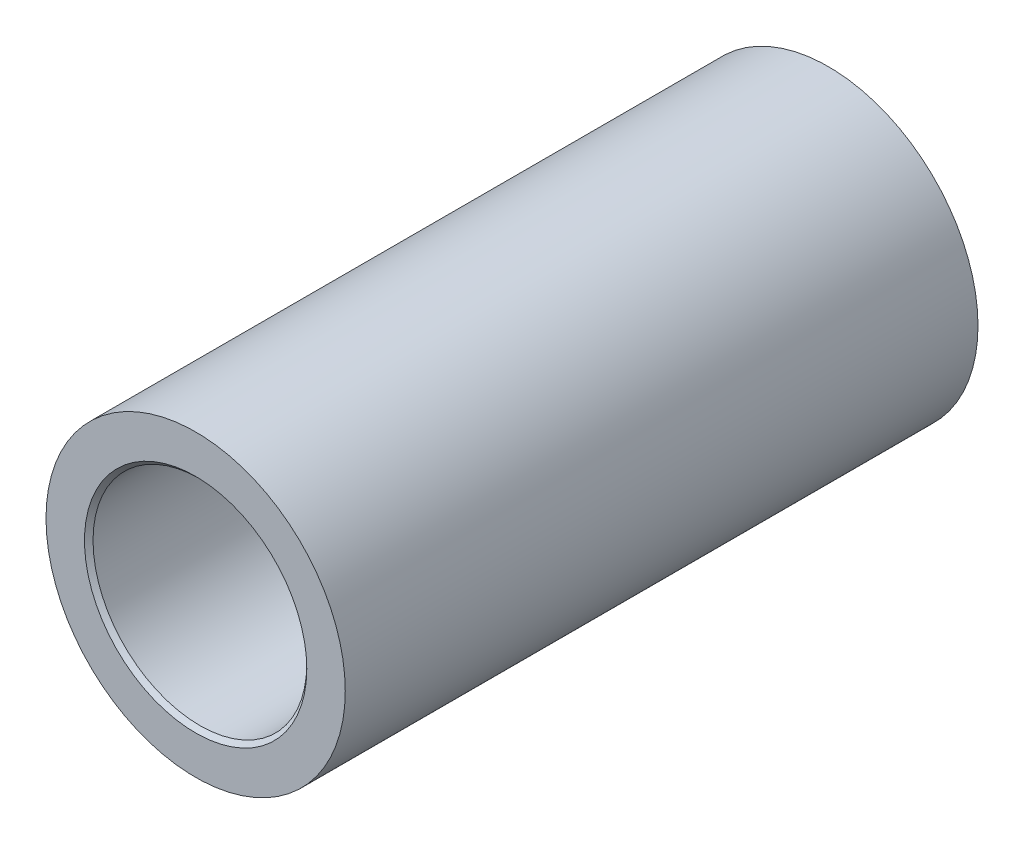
ISO-10303-21;
HEADER;
FILE_DESCRIPTION(('STEP AP214'),'2;1');
FILE_NAME('part.step','',(''),(''),'','','');
FILE_SCHEMA(('AUTOMOTIVE_DESIGN { 1 0 10303 214 1 1 1 1 }'));
ENDSEC;
DATA;
#1=APPLICATION_CONTEXT('core data for automotive mechanical design processes');
#2=APPLICATION_PROTOCOL_DEFINITION('international standard','automotive_design',2000,#1);
#3=PRODUCT_CONTEXT('',#1,'mechanical');
#4=PRODUCT('Part','Part','',(#3));
#5=PRODUCT_RELATED_PRODUCT_CATEGORY('part','',(#4));
#6=PRODUCT_DEFINITION_FORMATION('','',#4);
#7=PRODUCT_DEFINITION_CONTEXT('part definition',#1,'design');
#8=PRODUCT_DEFINITION('design','',#6,#7);
#9=PRODUCT_DEFINITION_SHAPE('','',#8);
#10=(LENGTH_UNIT() NAMED_UNIT(*) SI_UNIT(.MILLI.,.METRE.));
#11=(NAMED_UNIT(*) PLANE_ANGLE_UNIT() SI_UNIT($,.RADIAN.));
#12=(NAMED_UNIT(*) SI_UNIT($,.STERADIAN.) SOLID_ANGLE_UNIT());
#13=UNCERTAINTY_MEASURE_WITH_UNIT(LENGTH_MEASURE(1.E-05),#10,'distance_accuracy_value','');
#14=(GEOMETRIC_REPRESENTATION_CONTEXT(3) GLOBAL_UNCERTAINTY_ASSIGNED_CONTEXT((#13)) GLOBAL_UNIT_ASSIGNED_CONTEXT((#10,
#11,#12)) REPRESENTATION_CONTEXT('',''));
#15=CARTESIAN_POINT('',(0.,0.,0.));
#16=DIRECTION('',(0.,0.,1.));
#17=DIRECTION('',(1.,0.,0.));
#18=AXIS2_PLACEMENT_3D('',#15,#16,#17);
#19=CARTESIAN_POINT('',(0.,0.,73.9999999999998));
#20=DIRECTION('',(0.,0.,0.999999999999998));
#21=DIRECTION('',(1.,0.,0.));
#22=AXIS2_PLACEMENT_3D('',#19,#20,#21);
#23=PLANE('',#22);
#24=CARTESIAN_POINT('',(0.,0.,73.9999999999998));
#25=DIRECTION('',(0.,0.,0.999999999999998));
#26=DIRECTION('',(1.,0.,0.));
#27=AXIS2_PLACEMENT_3D('',#24,#25,#26);
#28=CIRCLE('',#27,13.);
#29=CARTESIAN_POINT('',(13.,0.,73.9999999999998));
#30=VERTEX_POINT('',#29);
#31=EDGE_CURVE('E10',#30,#30,#28,.F.);
#32=ORIENTED_EDGE('',*,*,#31,.T.);
#33=EDGE_LOOP('',(#32));
#34=FACE_BOUND('',#33,.T.);
#35=CARTESIAN_POINT('',(0.,0.,73.9999999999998));
#36=DIRECTION('',(0.,0.,0.999999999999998));
#37=DIRECTION('',(1.,0.,0.));
#38=AXIS2_PLACEMENT_3D('',#35,#36,#37);
#39=CIRCLE('',#38,17.5);
#40=CARTESIAN_POINT('',(-17.5,0.,73.9999999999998));
#41=VERTEX_POINT('',#40);
#42=EDGE_CURVE('E52',#41,#41,#39,.T.);
#43=ORIENTED_EDGE('',*,*,#42,.T.);
#44=EDGE_LOOP('',(#43));
#45=FACE_BOUND('',#44,.T.);
#46=ADVANCED_FACE('F32',(#34,#45),#23,.T.);
#47=CARTESIAN_POINT('',(0.,0.,0.));
#48=DIRECTION('',(0.,0.,0.999999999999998));
#49=DIRECTION('',(1.,0.,0.));
#50=AXIS2_PLACEMENT_3D('',#47,#48,#49);
#51=PLANE('',#50);
#52=CARTESIAN_POINT('',(0.,0.,0.));
#53=DIRECTION('',(0.,0.,0.999999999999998));
#54=DIRECTION('',(1.,0.,0.));
#55=AXIS2_PLACEMENT_3D('',#52,#53,#54);
#56=CIRCLE('',#55,13.);
#57=CARTESIAN_POINT('',(-13.,0.,0.));
#58=VERTEX_POINT('',#57);
#59=EDGE_CURVE('E47',#58,#58,#56,.T.);
#60=ORIENTED_EDGE('',*,*,#59,.T.);
#61=EDGE_LOOP('',(#60));
#62=FACE_BOUND('',#61,.T.);
#63=CARTESIAN_POINT('',(0.,0.,0.));
#64=DIRECTION('',(0.,0.,0.999999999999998));
#65=DIRECTION('',(1.,0.,0.));
#66=AXIS2_PLACEMENT_3D('',#63,#64,#65);
#67=CIRCLE('',#66,17.5);
#68=CARTESIAN_POINT('',(-17.5,0.,0.));
#69=VERTEX_POINT('',#68);
#70=EDGE_CURVE('E53',#69,#69,#67,.T.);
#71=ORIENTED_EDGE('',*,*,#70,.F.);
#72=EDGE_LOOP('',(#71));
#73=FACE_BOUND('',#72,.T.);
#74=ADVANCED_FACE('F64',(#62,#73),#51,.F.);
#75=CARTESIAN_POINT('',(0.,0.,73.9999999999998));
#76=DIRECTION('',(0.,0.,-0.999999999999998));
#77=DIRECTION('',(-1.,0.,0.));
#78=AXIS2_PLACEMENT_3D('',#75,#76,#77);
#79=CYLINDRICAL_SURFACE('',#78,17.5);
#80=CARTESIAN_POINT('',(-17.5,0.,73.9999999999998));
#81=CARTESIAN_POINT('',(-17.5,0.,73.2291666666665));
#82=CARTESIAN_POINT('',(-17.5,0.,72.4583333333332));
#83=CARTESIAN_POINT('',(-17.5,0.,70.9166666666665));
#84=CARTESIAN_POINT('',(-17.5,0.,70.1458333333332));
#85=CARTESIAN_POINT('',(-17.5,0.,68.6041666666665));
#86=CARTESIAN_POINT('',(-17.5,0.,67.8333333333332));
#87=CARTESIAN_POINT('',(-17.5,0.,66.2916666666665));
#88=CARTESIAN_POINT('',(-17.5,0.,65.5208333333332));
#89=CARTESIAN_POINT('',(-17.5,0.,63.9791666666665));
#90=CARTESIAN_POINT('',(-17.5,0.,63.2083333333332));
#91=CARTESIAN_POINT('',(-17.5,0.,61.6666666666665));
#92=CARTESIAN_POINT('',(-17.5,0.,60.8958333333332));
#93=CARTESIAN_POINT('',(-17.5,0.,59.3541666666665));
#94=CARTESIAN_POINT('',(-17.5,0.,58.5833333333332));
#95=CARTESIAN_POINT('',(-17.5,0.,57.0416666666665));
#96=CARTESIAN_POINT('',(-17.5,0.,56.2708333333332));
#97=CARTESIAN_POINT('',(-17.5,0.,54.7291666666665));
#98=CARTESIAN_POINT('',(-17.5,0.,53.9583333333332));
#99=CARTESIAN_POINT('',(-17.5,0.,52.4166666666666));
#100=CARTESIAN_POINT('',(-17.5,0.,51.6458333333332));
#101=CARTESIAN_POINT('',(-17.5,0.,50.1041666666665));
#102=CARTESIAN_POINT('',(-17.5,0.,49.3333333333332));
#103=CARTESIAN_POINT('',(-17.5,0.,47.7916666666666));
#104=CARTESIAN_POINT('',(-17.5,0.,47.0208333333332));
#105=CARTESIAN_POINT('',(-17.5,0.,45.4791666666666));
#106=CARTESIAN_POINT('',(-17.5,0.,44.7083333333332));
#107=CARTESIAN_POINT('',(-17.5,0.,43.1666666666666));
#108=CARTESIAN_POINT('',(-17.5,0.,42.3958333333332));
#109=CARTESIAN_POINT('',(-17.5,0.,40.8541666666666));
#110=CARTESIAN_POINT('',(-17.5,0.,40.0833333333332));
#111=CARTESIAN_POINT('',(-17.5,0.,38.5416666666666));
#112=CARTESIAN_POINT('',(-17.5,0.,37.7708333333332));
#113=CARTESIAN_POINT('',(-17.5,0.,36.2291666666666));
#114=CARTESIAN_POINT('',(-17.5,0.,35.4583333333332));
#115=CARTESIAN_POINT('',(-17.5,0.,33.9166666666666));
#116=CARTESIAN_POINT('',(-17.5,0.,33.1458333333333));
#117=CARTESIAN_POINT('',(-17.5,0.,31.6041666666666));
#118=CARTESIAN_POINT('',(-17.5,0.,30.8333333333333));
#119=CARTESIAN_POINT('',(-17.5,0.,29.2916666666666));
#120=CARTESIAN_POINT('',(-17.5,0.,28.5208333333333));
#121=CARTESIAN_POINT('',(-17.5,0.,26.9791666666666));
#122=CARTESIAN_POINT('',(-17.5,0.,26.2083333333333));
#123=CARTESIAN_POINT('',(-17.5,0.,24.6666666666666));
#124=CARTESIAN_POINT('',(-17.5,0.,23.8958333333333));
#125=CARTESIAN_POINT('',(-17.5,0.,22.3541666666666));
#126=CARTESIAN_POINT('',(-17.5,0.,21.5833333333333));
#127=CARTESIAN_POINT('',(-17.5,0.,20.0416666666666));
#128=CARTESIAN_POINT('',(-17.5,0.,19.2708333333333));
#129=CARTESIAN_POINT('',(-17.5,0.,17.7291666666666));
#130=CARTESIAN_POINT('',(-17.5,0.,16.9583333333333));
#131=CARTESIAN_POINT('',(-17.5,0.,15.4166666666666));
#132=CARTESIAN_POINT('',(-17.5,0.,14.6458333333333));
#133=CARTESIAN_POINT('',(-17.5,0.,13.1041666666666));
#134=CARTESIAN_POINT('',(-17.5,0.,12.3333333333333));
#135=CARTESIAN_POINT('',(-17.5,0.,10.7916666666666));
#136=CARTESIAN_POINT('',(-17.5,0.,10.0208333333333));
#137=CARTESIAN_POINT('',(-17.5,0.,8.47916666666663));
#138=CARTESIAN_POINT('',(-17.5,0.,7.7083333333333));
#139=CARTESIAN_POINT('',(-17.5,0.,6.16666666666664));
#140=CARTESIAN_POINT('',(-17.5,0.,5.39583333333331));
#141=CARTESIAN_POINT('',(-17.5,0.,3.85416666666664));
#142=CARTESIAN_POINT('',(-17.5,0.,3.0833333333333));
#143=CARTESIAN_POINT('',(-17.5,0.,1.54166666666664));
#144=CARTESIAN_POINT('',(-17.5,0.,0.770833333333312));
#145=CARTESIAN_POINT('',(-17.5,0.,0.));
#146=B_SPLINE_CURVE_WITH_KNOTS('',3,(#80,#81,#82,#83,#84,#85,#86,#87,#88,#89,#90,#91,#92,#93,
#94,#95,#96,#97,#98,#99,#100,#101,#102,#103,#104,#105,#106,#107,#108,#109,#110,#111,#112,#113,
#114,#115,#116,#117,#118,#119,#120,#121,#122,#123,#124,#125,#126,#127,#128,#129,#130,#131,#132,
#133,#134,#135,#136,#137,#138,#139,#140,#141,#142,#143,#144,#145),.UNSPECIFIED.,.F.,.F.,(4,2,2,
2,2,2,2,2,2,2,2,2,2,2,2,2,2,2,2,2,2,2,2,2,2,2,2,2,2,2,2,2,4),(0.,2.31249999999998,
4.62499999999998,6.93749999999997,9.24999999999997,11.5625,13.875,16.1875,18.5,20.8125,23.125,
25.4374999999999,27.7499999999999,30.0624999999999,32.3749999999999,34.6874999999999,
36.9999999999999,39.3124999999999,41.6249999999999,43.9374999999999,46.2499999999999,
48.5624999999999,50.8749999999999,53.1874999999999,55.4999999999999,57.8124999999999,
60.1249999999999,62.4374999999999,64.7499999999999,67.0624999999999,69.3749999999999,
71.6874999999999,73.9999999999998),.UNSPECIFIED.);
#147=EDGE_CURVE('BSEAM60',#41,#69,#146,.T.);
#148=ORIENTED_EDGE('',*,*,#42,.F.);
#149=ORIENTED_EDGE('',*,*,#70,.T.);
#150=ORIENTED_EDGE('',*,*,#147,.T.);
#151=ORIENTED_EDGE('',*,*,#147,.F.);
#152=EDGE_LOOP('',(#148,#150,#149,#151));
#153=FACE_BOUND('',#152,.T.);
#154=ADVANCED_FACE('F60',(#153),#79,.T.);
#155=CARTESIAN_POINT('',(0.,0.,73.9999999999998));
#156=DIRECTION('',(0.,0.,-0.999999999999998));
#157=DIRECTION('',(-1.,0.,0.));
#158=AXIS2_PLACEMENT_3D('',#155,#156,#157);
#159=CYLINDRICAL_SURFACE('',#158,12.5);
#160=CARTESIAN_POINT('',(0.,0.,0.499999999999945));
#161=DIRECTION('',(0.,0.,0.999999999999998));
#162=DIRECTION('',(1.,0.,0.));
#163=AXIS2_PLACEMENT_3D('',#160,#161,#162);
#164=CIRCLE('',#163,12.5);
#165=CARTESIAN_POINT('',(-12.5,0.,0.499999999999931));
#166=VERTEX_POINT('',#165);
#167=EDGE_CURVE('E39',#166,#166,#164,.F.);
#168=CARTESIAN_POINT('',(0.,0.,73.4999999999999));
#169=DIRECTION('',(0.,0.,0.999999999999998));
#170=DIRECTION('',(1.,0.,0.));
#171=AXIS2_PLACEMENT_3D('',#168,#169,#170);
#172=CIRCLE('',#171,12.5);
#173=CARTESIAN_POINT('',(-12.5,0.,73.4999999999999));
#174=VERTEX_POINT('',#173);
#175=EDGE_CURVE('E43',#174,#174,#172,.T.);
#176=CARTESIAN_POINT('',(-12.5,0.,0.499999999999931));
#177=CARTESIAN_POINT('',(-12.5,0.,1.26041666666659));
#178=CARTESIAN_POINT('',(-12.5,0.,2.02083333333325));
#179=CARTESIAN_POINT('',(-12.5,0.,3.54166666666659));
#180=CARTESIAN_POINT('',(-12.5,0.,4.30208333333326));
#181=CARTESIAN_POINT('',(-12.5,0.,5.82291666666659));
#182=CARTESIAN_POINT('',(-12.5,0.,6.58333333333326));
#183=CARTESIAN_POINT('',(-12.5,0.,8.10416666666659));
#184=CARTESIAN_POINT('',(-12.5,0.,8.86458333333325));
#185=CARTESIAN_POINT('',(-12.5,0.,10.3854166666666));
#186=CARTESIAN_POINT('',(-12.5,0.,11.1458333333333));
#187=CARTESIAN_POINT('',(-12.5,0.,12.6666666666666));
#188=CARTESIAN_POINT('',(-12.5,0.,13.4270833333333));
#189=CARTESIAN_POINT('',(-12.5,0.,14.9479166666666));
#190=CARTESIAN_POINT('',(-12.5,0.,15.7083333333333));
#191=CARTESIAN_POINT('',(-12.5,0.,17.2291666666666));
#192=CARTESIAN_POINT('',(-12.5,0.,17.9895833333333));
#193=CARTESIAN_POINT('',(-12.5,0.,19.5104166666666));
#194=CARTESIAN_POINT('',(-12.5,0.,20.2708333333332));
#195=CARTESIAN_POINT('',(-12.5,0.,21.7916666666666));
#196=CARTESIAN_POINT('',(-12.5,0.,22.5520833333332));
#197=CARTESIAN_POINT('',(-12.5,0.,24.0729166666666));
#198=CARTESIAN_POINT('',(-12.5,0.,24.8333333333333));
#199=CARTESIAN_POINT('',(-12.5,0.,26.3541666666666));
#200=CARTESIAN_POINT('',(-12.5,0.,27.1145833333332));
#201=CARTESIAN_POINT('',(-12.5,0.,28.6354166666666));
#202=CARTESIAN_POINT('',(-12.5,0.,29.3958333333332));
#203=CARTESIAN_POINT('',(-12.5,0.,30.9166666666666));
#204=CARTESIAN_POINT('',(-12.5,0.,31.6770833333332));
#205=CARTESIAN_POINT('',(-12.5,0.,33.1979166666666));
#206=CARTESIAN_POINT('',(-12.5,0.,33.9583333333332));
#207=CARTESIAN_POINT('',(-12.5,0.,35.4791666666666));
#208=CARTESIAN_POINT('',(-12.5,0.,36.2395833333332));
#209=CARTESIAN_POINT('',(-12.5,0.,37.7604166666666));
#210=CARTESIAN_POINT('',(-12.5,0.,38.5208333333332));
#211=CARTESIAN_POINT('',(-12.5,0.,40.0416666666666));
#212=CARTESIAN_POINT('',(-12.5,0.,40.8020833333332));
#213=CARTESIAN_POINT('',(-12.5,0.,42.3229166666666));
#214=CARTESIAN_POINT('',(-12.5,0.,43.0833333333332));
#215=CARTESIAN_POINT('',(-12.5,0.,44.6041666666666));
#216=CARTESIAN_POINT('',(-12.5,0.,45.3645833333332));
#217=CARTESIAN_POINT('',(-12.5,0.,46.8854166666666));
#218=CARTESIAN_POINT('',(-12.5,0.,47.6458333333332));
#219=CARTESIAN_POINT('',(-12.5,0.,49.1666666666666));
#220=CARTESIAN_POINT('',(-12.5,0.,49.9270833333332));
#221=CARTESIAN_POINT('',(-12.5,0.,51.4479166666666));
#222=CARTESIAN_POINT('',(-12.5,0.,52.2083333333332));
#223=CARTESIAN_POINT('',(-12.5,0.,53.7291666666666));
#224=CARTESIAN_POINT('',(-12.5,0.,54.4895833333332));
#225=CARTESIAN_POINT('',(-12.5,0.,56.0104166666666));
#226=CARTESIAN_POINT('',(-12.5,0.,56.7708333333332));
#227=CARTESIAN_POINT('',(-12.5,0.,58.2916666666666));
#228=CARTESIAN_POINT('',(-12.5,0.,59.0520833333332));
#229=CARTESIAN_POINT('',(-12.5,0.,60.5729166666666));
#230=CARTESIAN_POINT('',(-12.5,0.,61.3333333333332));
#231=CARTESIAN_POINT('',(-12.5,0.,62.8541666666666));
#232=CARTESIAN_POINT('',(-12.5,0.,63.6145833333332));
#233=CARTESIAN_POINT('',(-12.5,0.,65.1354166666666));
#234=CARTESIAN_POINT('',(-12.5,0.,65.8958333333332));
#235=CARTESIAN_POINT('',(-12.5,0.,67.4166666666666));
#236=CARTESIAN_POINT('',(-12.5,0.,68.1770833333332));
#237=CARTESIAN_POINT('',(-12.5,0.,69.6979166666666));
#238=CARTESIAN_POINT('',(-12.5,0.,70.4583333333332));
#239=CARTESIAN_POINT('',(-12.5,0.,71.9791666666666));
#240=CARTESIAN_POINT('',(-12.5,0.,72.7395833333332));
#241=CARTESIAN_POINT('',(-12.5,0.,73.4999999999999));
#242=B_SPLINE_CURVE_WITH_KNOTS('',3,(#176,#177,#178,#179,#180,#181,#182,#183,#184,#185,#186,
#187,#188,#189,#190,#191,#192,#193,#194,#195,#196,#197,#198,#199,#200,#201,#202,#203,#204,#205,
#206,#207,#208,#209,#210,#211,#212,#213,#214,#215,#216,#217,#218,#219,#220,#221,#222,#223,#224,
#225,#226,#227,#228,#229,#230,#231,#232,#233,#234,#235,#236,#237,#238,#239,#240,#241),
.UNSPECIFIED.,.F.,.F.,(4,2,2,2,2,2,2,2,2,2,2,2,2,2,2,2,2,2,2,2,2,2,2,2,2,2,2,2,2,2,2,2,4),(0.,
2.28124999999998,4.5625,6.84375,9.12499999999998,11.40625,13.6875,15.96875,18.25,20.53125,
22.8125,25.09375,27.375,29.65625,31.9375,34.21875,36.5,38.78125,41.0625,43.34375,45.625,
47.90625,50.1875,52.46875,54.75,57.03125,59.3125,61.59375,63.875,66.15625,68.4375,70.71875,73.),.UNSPECIFIED.);
#243=EDGE_CURVE('BSEAM63',#166,#174,#242,.T.);
#244=ORIENTED_EDGE('',*,*,#167,.T.);
#245=ORIENTED_EDGE('',*,*,#175,.T.);
#246=ORIENTED_EDGE('',*,*,#243,.T.);
#247=ORIENTED_EDGE('',*,*,#243,.F.);
#248=EDGE_LOOP('',(#244,#246,#245,#247));
#249=FACE_BOUND('',#248,.T.);
#250=ADVANCED_FACE('F63',(#249),#159,.F.);
#251=CARTESIAN_POINT('',(0.,0.,0.));
#252=DIRECTION('',(0.,0.,-0.999999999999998));
#253=DIRECTION('',(-1.,0.,0.));
#254=AXIS2_PLACEMENT_3D('',#251,#252,#253);
#255=CONICAL_SURFACE('',#254,13.,0.785398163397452);
#256=CARTESIAN_POINT('',(-12.5000000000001,0.,0.499999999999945));
#257=CARTESIAN_POINT('',(-12.5052083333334,0.,0.494791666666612));
#258=CARTESIAN_POINT('',(-12.5104166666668,0.,0.489583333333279));
#259=CARTESIAN_POINT('',(-12.5208333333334,0.,0.479166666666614));
#260=CARTESIAN_POINT('',(-12.5260416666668,0.,0.473958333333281));
#261=CARTESIAN_POINT('',(-12.5364583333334,0.,0.463541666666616));
#262=CARTESIAN_POINT('',(-12.5416666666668,0.,0.458333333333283));
#263=CARTESIAN_POINT('',(-12.5520833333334,0.,0.447916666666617));
#264=CARTESIAN_POINT('',(-12.5572916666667,0.,0.442708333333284));
#265=CARTESIAN_POINT('',(-12.5677083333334,0.,0.432291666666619));
#266=CARTESIAN_POINT('',(-12.5729166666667,0.,0.427083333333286));
#267=CARTESIAN_POINT('',(-12.5833333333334,0.,0.416666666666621));
#268=CARTESIAN_POINT('',(-12.5885416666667,0.,0.411458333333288));
#269=CARTESIAN_POINT('',(-12.5989583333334,0.,0.401041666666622));
#270=CARTESIAN_POINT('',(-12.6041666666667,0.,0.39583333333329));
#271=CARTESIAN_POINT('',(-12.6145833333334,0.,0.385416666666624));
#272=CARTESIAN_POINT('',(-12.6197916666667,0.,0.380208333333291));
#273=CARTESIAN_POINT('',(-12.6302083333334,0.,0.369791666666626));
#274=CARTESIAN_POINT('',(-12.6354166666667,0.,0.364583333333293));
#275=CARTESIAN_POINT('',(-12.6458333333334,0.,0.354166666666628));
#276=CARTESIAN_POINT('',(-12.6510416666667,0.,0.348958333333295));
#277=CARTESIAN_POINT('',(-12.6614583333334,0.,0.338541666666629));
#278=CARTESIAN_POINT('',(-12.6666666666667,0.,0.333333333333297));
#279=CARTESIAN_POINT('',(-12.6770833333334,0.,0.322916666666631));
#280=CARTESIAN_POINT('',(-12.6822916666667,0.,0.317708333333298));
#281=CARTESIAN_POINT('',(-12.6927083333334,0.,0.307291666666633));
#282=CARTESIAN_POINT('',(-12.6979166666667,0.,0.3020833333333));
#283=CARTESIAN_POINT('',(-12.7083333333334,0.,0.291666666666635));
#284=CARTESIAN_POINT('',(-12.7135416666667,0.,0.286458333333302));
#285=CARTESIAN_POINT('',(-12.7239583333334,0.,0.276041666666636));
#286=CARTESIAN_POINT('',(-12.7291666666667,0.,0.270833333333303));
#287=CARTESIAN_POINT('',(-12.7395833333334,0.,0.260416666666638));
#288=CARTESIAN_POINT('',(-12.7447916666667,0.,0.255208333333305));
#289=CARTESIAN_POINT('',(-12.7552083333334,0.,0.24479166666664));
#290=CARTESIAN_POINT('',(-12.7604166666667,0.,0.239583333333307));
#291=CARTESIAN_POINT('',(-12.7708333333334,0.,0.229166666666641));
#292=CARTESIAN_POINT('',(-12.7760416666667,0.,0.223958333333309));
#293=CARTESIAN_POINT('',(-12.7864583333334,0.,0.213541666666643));
#294=CARTESIAN_POINT('',(-12.7916666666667,0.,0.20833333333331));
#295=CARTESIAN_POINT('',(-12.8020833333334,0.,0.197916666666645));
#296=CARTESIAN_POINT('',(-12.8072916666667,0.,0.192708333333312));
#297=CARTESIAN_POINT('',(-12.8177083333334,0.,0.182291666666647));
#298=CARTESIAN_POINT('',(-12.8229166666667,0.,0.177083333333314));
#299=CARTESIAN_POINT('',(-12.8333333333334,0.,0.166666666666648));
#300=CARTESIAN_POINT('',(-12.8385416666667,0.,0.161458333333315));
#301=CARTESIAN_POINT('',(-12.8489583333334,0.,0.15104166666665));
#302=CARTESIAN_POINT('',(-12.8541666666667,0.,0.145833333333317));
#303=CARTESIAN_POINT('',(-12.8645833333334,0.,0.135416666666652));
#304=CARTESIAN_POINT('',(-12.8697916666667,0.,0.130208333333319));
#305=CARTESIAN_POINT('',(-12.8802083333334,0.,0.119791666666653));
#306=CARTESIAN_POINT('',(-12.8854166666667,0.,0.114583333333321));
#307=CARTESIAN_POINT('',(-12.8958333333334,0.,0.104166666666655));
#308=CARTESIAN_POINT('',(-12.9010416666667,0.,0.0989583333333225));
#309=CARTESIAN_POINT('',(-12.9114583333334,0.,0.0885416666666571));
#310=CARTESIAN_POINT('',(-12.9166666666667,0.,0.0833333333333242));
#311=CARTESIAN_POINT('',(-12.9270833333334,0.,0.0729166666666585));
#312=CARTESIAN_POINT('',(-12.9322916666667,0.,0.0677083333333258));
#313=CARTESIAN_POINT('',(-12.9427083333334,0.,0.0572916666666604));
#314=CARTESIAN_POINT('',(-12.9479166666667,0.,0.0520833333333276));
#315=CARTESIAN_POINT('',(-12.9583333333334,0.,0.0416666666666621));
#316=CARTESIAN_POINT('',(-12.9635416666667,0.,0.0364583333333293));
#317=CARTESIAN_POINT('',(-12.9739583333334,0.,0.0260416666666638));
#318=CARTESIAN_POINT('',(-12.9791666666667,0.,0.020833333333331));
#319=CARTESIAN_POINT('',(-12.9895833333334,0.,0.0104166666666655));
#320=CARTESIAN_POINT('',(-12.9947916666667,0.,0.00520833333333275));
#321=CARTESIAN_POINT('',(-13.,0.,0.));
#322=B_SPLINE_CURVE_WITH_KNOTS('',3,(#256,#257,#258,#259,#260,#261,#262,#263,#264,#265,#266,
#267,#268,#269,#270,#271,#272,#273,#274,#275,#276,#277,#278,#279,#280,#281,#282,#283,#284,#285,
#286,#287,#288,#289,#290,#291,#292,#293,#294,#295,#296,#297,#298,#299,#300,#301,#302,#303,#304,
#305,#306,#307,#308,#309,#310,#311,#312,#313,#314,#315,#316,#317,#318,#319,#320,#321),
.UNSPECIFIED.,.F.,.F.,(4,2,2,2,2,2,2,2,2,2,2,2,2,2,2,2,2,2,2,2,2,2,2,2,2,2,2,2,2,2,2,2,4),(0.,
0.0220970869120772,0.0441941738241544,0.0662912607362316,0.0883883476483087,0.110485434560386,
0.132582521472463,0.15467960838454,0.176776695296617,0.198873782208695,0.220970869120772,
0.243067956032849,0.265165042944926,0.287262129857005,0.309359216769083,0.33145630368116,
0.353553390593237,0.375650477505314,0.397747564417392,0.419844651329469,0.441941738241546,
0.464038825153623,0.4861359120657,0.508232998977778,0.530330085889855,0.552427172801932,
0.57452425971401,0.596621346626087,0.618718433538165,0.640815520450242,0.662912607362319,
0.685009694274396,0.707106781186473),.UNSPECIFIED.);
#323=EDGE_CURVE('BSEAM76',#166,#58,#322,.T.);
#324=ORIENTED_EDGE('',*,*,#167,.F.);
#325=ORIENTED_EDGE('',*,*,#59,.F.);
#326=ORIENTED_EDGE('',*,*,#323,.T.);
#327=ORIENTED_EDGE('',*,*,#323,.F.);
#328=EDGE_LOOP('',(#324,#326,#325,#327));
#329=FACE_BOUND('',#328,.T.);
#330=ADVANCED_FACE('F76',(#329),#255,.F.);
#331=CARTESIAN_POINT('',(0.,0.,73.4999999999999));
#332=DIRECTION('',(0.,0.,0.999999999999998));
#333=DIRECTION('',(1.,0.,0.));
#334=AXIS2_PLACEMENT_3D('',#331,#332,#333);
#335=CONICAL_SURFACE('',#334,12.5,0.785398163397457);
#336=ORIENTED_EDGE('',*,*,#31,.F.);
#337=EDGE_LOOP('',(#336));
#338=FACE_BOUND('',#337,.T.);
#339=ORIENTED_EDGE('',*,*,#175,.F.);
#340=EDGE_LOOP('',(#339));
#341=FACE_BOUND('',#340,.T.);
#342=ADVANCED_FACE('F34',(#338,#341),#335,.F.);
#343=CLOSED_SHELL('',(#46,#74,#154,#250,#330,#342));
#344=MANIFOLD_SOLID_BREP('B2',#343);
#345=ADVANCED_BREP_SHAPE_REPRESENTATION('',(#18,#344),#14);
#346=SHAPE_DEFINITION_REPRESENTATION(#9,#345);
ENDSEC;
END-ISO-10303-21;
